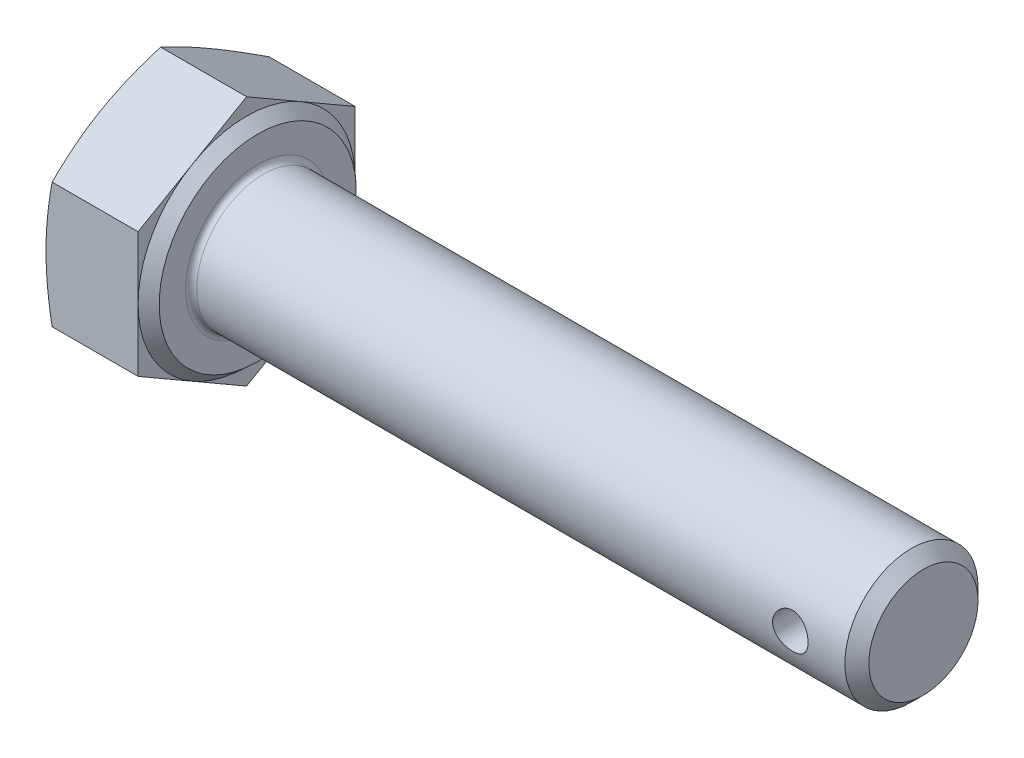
ISO-10303-21;
HEADER;
FILE_DESCRIPTION(('STEP AP214'),'2;1');
FILE_NAME('part.step','',(''),(''),'','','');
FILE_SCHEMA(('AUTOMOTIVE_DESIGN { 1 0 10303 214 1 1 1 1 }'));
ENDSEC;
DATA;
#1=APPLICATION_CONTEXT('core data for automotive mechanical design processes');
#2=APPLICATION_PROTOCOL_DEFINITION('international standard','automotive_design',2000,#1);
#3=PRODUCT_CONTEXT('',#1,'mechanical');
#4=PRODUCT('Part','Part','',(#3));
#5=PRODUCT_RELATED_PRODUCT_CATEGORY('part','',(#4));
#6=PRODUCT_DEFINITION_FORMATION('','',#4);
#7=PRODUCT_DEFINITION_CONTEXT('part definition',#1,'design');
#8=PRODUCT_DEFINITION('design','',#6,#7);
#9=PRODUCT_DEFINITION_SHAPE('','',#8);
#10=(LENGTH_UNIT() NAMED_UNIT(*) SI_UNIT(.MILLI.,.METRE.));
#11=(NAMED_UNIT(*) PLANE_ANGLE_UNIT() SI_UNIT($,.RADIAN.));
#12=(NAMED_UNIT(*) SI_UNIT($,.STERADIAN.) SOLID_ANGLE_UNIT());
#13=UNCERTAINTY_MEASURE_WITH_UNIT(LENGTH_MEASURE(1.E-05),#10,'distance_accuracy_value','');
#14=(GEOMETRIC_REPRESENTATION_CONTEXT(3) GLOBAL_UNCERTAINTY_ASSIGNED_CONTEXT((#13)) GLOBAL_UNIT_ASSIGNED_CONTEXT((#10,
#11,#12)) REPRESENTATION_CONTEXT('',''));
#15=CARTESIAN_POINT('',(0.,0.,0.));
#16=DIRECTION('',(0.,0.,1.));
#17=DIRECTION('',(1.,0.,0.));
#18=AXIS2_PLACEMENT_3D('',#15,#16,#17);
#19=CARTESIAN_POINT('',(4.65,0.,0.));
#20=DIRECTION('',(-1.,0.,0.));
#21=DIRECTION('',(0.,-1.,0.));
#22=AXIS2_PLACEMENT_3D('',#19,#20,#21);
#23=PLANE('',#22);
#24=CARTESIAN_POINT('',(4.65,0.,0.));
#25=DIRECTION('',(-1.,0.,0.));
#26=DIRECTION('',(0.,-1.,0.));
#27=AXIS2_PLACEMENT_3D('',#24,#25,#26);
#28=CIRCLE('',#27,3.25);
#29=CARTESIAN_POINT('',(4.65,-3.25,0.));
#30=VERTEX_POINT('',#29);
#31=EDGE_CURVE('E11',#30,#30,#28,.T.);
#32=ORIENTED_EDGE('',*,*,#31,.T.);
#33=EDGE_LOOP('',(#32));
#34=FACE_BOUND('',#33,.T.);
#35=CARTESIAN_POINT('',(4.65,0.,0.));
#36=DIRECTION('',(-1.,0.,0.));
#37=DIRECTION('',(0.,-1.,0.));
#38=AXIS2_PLACEMENT_3D('',#35,#36,#37);
#39=CIRCLE('',#38,4.44);
#40=CARTESIAN_POINT('',(4.65,-4.43999999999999,0.));
#41=VERTEX_POINT('',#40);
#42=EDGE_CURVE('E145',#41,#41,#39,.T.);
#43=ORIENTED_EDGE('',*,*,#42,.F.);
#44=EDGE_LOOP('',(#43));
#45=FACE_BOUND('',#44,.T.);
#46=ADVANCED_FACE('F32',(#34,#45),#23,.F.);
#47=CARTESIAN_POINT('',(4.15,-8.46972844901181,-4.89));
#48=DIRECTION('',(1.,0.,0.));
#49=DIRECTION('',(0.,0.,-1.));
#50=AXIS2_PLACEMENT_3D('',#47,#48,#49);
#51=PLANE('',#50);
#52=DIRECTION('',(0.,-0.5,-0.866025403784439));
#53=VECTOR('',#52,1.);
#54=CARTESIAN_POINT('',(4.15,-2.82324281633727,4.89));
#55=LINE('',#54,#53);
#56=CARTESIAN_POINT('',(4.15,-2.82324281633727,4.89));
#57=VERTEX_POINT('',#56);
#58=CARTESIAN_POINT('',(4.15,-4.2348642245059,2.445));
#59=VERTEX_POINT('',#58);
#60=EDGE_CURVE('E144',#57,#59,#55,.T.);
#61=ORIENTED_EDGE('',*,*,#60,.T.);
#62=CARTESIAN_POINT('',(4.15,0.,0.));
#63=DIRECTION('',(-1.,0.,0.));
#64=DIRECTION('',(0.,-1.,0.));
#65=AXIS2_PLACEMENT_3D('',#62,#63,#64);
#66=CIRCLE('',#65,4.89);
#67=CARTESIAN_POINT('',(4.15,0.,4.89));
#68=VERTEX_POINT('',#67);
#69=EDGE_CURVE('E54',#59,#68,#66,.T.);
#70=ORIENTED_EDGE('',*,*,#69,.T.);
#71=DIRECTION('',(0.,-1.,0.));
#72=VECTOR('',#71,1.);
#73=CARTESIAN_POINT('',(4.15,2.82324281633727,4.89));
#74=LINE('',#73,#72);
#75=EDGE_CURVE('E141',#68,#57,#74,.T.);
#76=ORIENTED_EDGE('',*,*,#75,.T.);
#77=EDGE_LOOP('',(#61,#70,#76));
#78=FACE_BOUND('',#77,.T.);
#79=ADVANCED_FACE('F140',(#78),#51,.T.);
#80=CARTESIAN_POINT('',(4.15,2.82324281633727,4.89));
#81=VERTEX_POINT('',#80);
#82=EDGE_CURVE('E152',#81,#68,#74,.T.);
#83=ORIENTED_EDGE('',*,*,#82,.T.);
#84=CARTESIAN_POINT('',(4.15,4.23486422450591,2.445));
#85=VERTEX_POINT('',#84);
#86=EDGE_CURVE('E127',#68,#85,#66,.T.);
#87=ORIENTED_EDGE('',*,*,#86,.T.);
#88=DIRECTION('',(0.,-0.5,0.866025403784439));
#89=VECTOR('',#88,1.);
#90=CARTESIAN_POINT('',(4.15,5.64648563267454,0.));
#91=LINE('',#90,#89);
#92=EDGE_CURVE('E158',#85,#81,#91,.T.);
#93=ORIENTED_EDGE('',*,*,#92,.T.);
#94=EDGE_LOOP('',(#83,#87,#93));
#95=FACE_BOUND('',#94,.T.);
#96=ADVANCED_FACE('F157',(#95),#51,.T.);
#97=CARTESIAN_POINT('',(4.15,5.64648563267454,0.));
#98=VERTEX_POINT('',#97);
#99=EDGE_CURVE('E155',#98,#85,#91,.T.);
#100=ORIENTED_EDGE('',*,*,#99,.T.);
#101=CARTESIAN_POINT('',(4.15,4.23486422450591,-2.445));
#102=VERTEX_POINT('',#101);
#103=EDGE_CURVE('E131',#85,#102,#66,.T.);
#104=ORIENTED_EDGE('',*,*,#103,.T.);
#105=DIRECTION('',(0.,0.5,0.866025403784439));
#106=VECTOR('',#105,1.);
#107=CARTESIAN_POINT('',(4.15,2.82324281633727,-4.89));
#108=LINE('',#107,#106);
#109=EDGE_CURVE('E324',#102,#98,#108,.T.);
#110=ORIENTED_EDGE('',*,*,#109,.T.);
#111=EDGE_LOOP('',(#100,#104,#110));
#112=FACE_BOUND('',#111,.T.);
#113=ADVANCED_FACE('F336',(#112),#51,.T.);
#114=CARTESIAN_POINT('',(4.15,2.82324281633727,-4.89));
#115=VERTEX_POINT('',#114);
#116=EDGE_CURVE('E326',#115,#102,#108,.T.);
#117=ORIENTED_EDGE('',*,*,#116,.T.);
#118=CARTESIAN_POINT('',(4.15,0.,-4.89));
#119=VERTEX_POINT('',#118);
#120=EDGE_CURVE('E379',#102,#119,#66,.T.);
#121=ORIENTED_EDGE('',*,*,#120,.T.);
#122=DIRECTION('',(0.,1.,0.));
#123=VECTOR('',#122,1.);
#124=CARTESIAN_POINT('',(4.15,-2.82324281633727,-4.89));
#125=LINE('',#124,#123);
#126=EDGE_CURVE('E321',#119,#115,#125,.T.);
#127=ORIENTED_EDGE('',*,*,#126,.T.);
#128=EDGE_LOOP('',(#117,#121,#127));
#129=FACE_BOUND('',#128,.T.);
#130=ADVANCED_FACE('F380',(#129),#51,.T.);
#131=CARTESIAN_POINT('',(4.15,-2.82324281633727,-4.89));
#132=VERTEX_POINT('',#131);
#133=EDGE_CURVE('E319',#132,#119,#125,.T.);
#134=ORIENTED_EDGE('',*,*,#133,.T.);
#135=CARTESIAN_POINT('',(4.15,-4.2348642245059,-2.445));
#136=VERTEX_POINT('',#135);
#137=EDGE_CURVE('E363',#119,#136,#66,.T.);
#138=ORIENTED_EDGE('',*,*,#137,.T.);
#139=DIRECTION('',(0.,0.5,-0.866025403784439));
#140=VECTOR('',#139,1.);
#141=CARTESIAN_POINT('',(4.15,-5.64648563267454,0.));
#142=LINE('',#141,#140);
#143=EDGE_CURVE('E377',#136,#132,#142,.T.);
#144=ORIENTED_EDGE('',*,*,#143,.T.);
#145=EDGE_LOOP('',(#134,#138,#144));
#146=FACE_BOUND('',#145,.T.);
#147=ADVANCED_FACE('F378',(#146),#51,.T.);
#148=CARTESIAN_POINT('',(4.15,-5.64648563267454,0.));
#149=VERTEX_POINT('',#148);
#150=EDGE_CURVE('E327',#149,#136,#142,.T.);
#151=ORIENTED_EDGE('',*,*,#150,.T.);
#152=EDGE_CURVE('E146',#136,#59,#66,.T.);
#153=ORIENTED_EDGE('',*,*,#152,.T.);
#154=EDGE_CURVE('E372',#59,#149,#55,.T.);
#155=ORIENTED_EDGE('',*,*,#154,.T.);
#156=EDGE_LOOP('',(#151,#153,#155));
#157=FACE_BOUND('',#156,.T.);
#158=ADVANCED_FACE('F224',(#157),#51,.T.);
#159=CARTESIAN_POINT('',(4.15,-2.82324281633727,4.89));
#160=DIRECTION('',(0.,0.866025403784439,-0.5));
#161=DIRECTION('',(0.,0.5,0.866025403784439));
#162=AXIS2_PLACEMENT_3D('',#159,#160,#161);
#163=PLANE('',#162);
#164=CARTESIAN_POINT('',(0.27538028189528,-5.64660110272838,-0.000199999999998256));
#165=CARTESIAN_POINT('',(0.232806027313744,-5.52967490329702,0.202322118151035));
#166=CARTESIAN_POINT('',(0.194077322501,-5.41236312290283,0.405512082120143));
#167=CARTESIAN_POINT('',(0.125940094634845,-5.17697676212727,0.813213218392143));
#168=CARTESIAN_POINT('',(0.0965388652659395,-5.05890165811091,1.01772529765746));
#169=CARTESIAN_POINT('',(0.0489831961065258,-4.82329906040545,1.42580096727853));
#170=CARTESIAN_POINT('',(0.0307250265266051,-4.7057769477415,1.62935523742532));
#171=CARTESIAN_POINT('',(0.00623568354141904,-4.470457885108,2.03693980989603));
#172=CARTESIAN_POINT('',(0.,-4.35266105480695,2.24096990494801));
#173=CARTESIAN_POINT('',(0.,-4.11706739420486,2.64903009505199));
#174=CARTESIAN_POINT('',(0.00623568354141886,-3.99927056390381,2.85306019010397));
#175=CARTESIAN_POINT('',(0.0307250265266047,-3.76395150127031,3.26064476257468));
#176=CARTESIAN_POINT('',(0.0489831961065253,-3.64642938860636,3.46419903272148));
#177=CARTESIAN_POINT('',(0.0965388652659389,-3.4108267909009,3.87227470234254));
#178=CARTESIAN_POINT('',(0.125940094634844,-3.29275168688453,4.07678678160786));
#179=CARTESIAN_POINT('',(0.194077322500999,-3.05736532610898,4.48448791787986));
#180=CARTESIAN_POINT('',(0.232806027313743,-2.94005354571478,4.68767788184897));
#181=CARTESIAN_POINT('',(0.27538028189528,-2.82312734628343,4.8902));
#182=B_SPLINE_CURVE_WITH_KNOTS('',3,(#164,#165,#166,#167,#168,#169,#170,#171,#172,#173,#174,
#175,#176,#177,#178,#179,#180,#181),.UNSPECIFIED.,.F.,.F.,(4,2,2,2,2,2,2,2,4),(0.,
0.713162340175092,1.42688097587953,2.13385008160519,2.84055392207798,3.54725776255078,
4.25422686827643,4.96794550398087,5.68110784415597),.UNSPECIFIED.);
#183=CARTESIAN_POINT('',(0.275338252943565,-5.64648563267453,0.));
#184=VERTEX_POINT('',#183);
#185=CARTESIAN_POINT('',(0.,-4.23486422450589,2.44499999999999));
#186=VERTEX_POINT('',#185);
#187=EDGE_CURVE('E366',#184,#186,#182,.T.);
#188=ORIENTED_EDGE('',*,*,#187,.F.);
#189=DIRECTION('',(-1.,0.,0.));
#190=VECTOR('',#189,1.);
#191=CARTESIAN_POINT('',(4.15,-5.64648563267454,0.));
#192=LINE('',#191,#190);
#193=EDGE_CURVE('E175',#149,#184,#192,.T.);
#194=ORIENTED_EDGE('',*,*,#193,.F.);
#195=ORIENTED_EDGE('',*,*,#154,.F.);
#196=ORIENTED_EDGE('',*,*,#60,.F.);
#197=DIRECTION('',(-1.,0.,0.));
#198=VECTOR('',#197,1.);
#199=CARTESIAN_POINT('',(4.15,-2.82324281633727,4.89));
#200=LINE('',#199,#198);
#201=CARTESIAN_POINT('',(0.275338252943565,-2.82324281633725,4.89));
#202=VERTEX_POINT('',#201);
#203=EDGE_CURVE('E154',#57,#202,#200,.T.);
#204=ORIENTED_EDGE('',*,*,#203,.T.);
#205=EDGE_CURVE('E256',#186,#202,#182,.T.);
#206=ORIENTED_EDGE('',*,*,#205,.F.);
#207=EDGE_LOOP('',(#188,#194,#195,#196,#204,#206));
#208=FACE_BOUND('',#207,.T.);
#209=ADVANCED_FACE('F34',(#208),#163,.F.);
#210=CARTESIAN_POINT('',(4.15,-5.64648563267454,0.));
#211=DIRECTION('',(0.,0.866025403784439,0.5));
#212=DIRECTION('',(0.,-0.5,0.866025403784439));
#213=AXIS2_PLACEMENT_3D('',#210,#211,#212);
#214=PLANE('',#213);
#215=CARTESIAN_POINT('',(0.275380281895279,-2.82312734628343,-4.8902));
#216=CARTESIAN_POINT('',(0.232806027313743,-2.94005354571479,-4.68767788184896));
#217=CARTESIAN_POINT('',(0.194077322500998,-3.05736532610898,-4.48448791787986));
#218=CARTESIAN_POINT('',(0.125940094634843,-3.29275168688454,-4.07678678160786));
#219=CARTESIAN_POINT('',(0.0965388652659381,-3.4108267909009,-3.87227470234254));
#220=CARTESIAN_POINT('',(0.0489831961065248,-3.64642938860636,-3.46419903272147));
#221=CARTESIAN_POINT('',(0.0307250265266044,-3.76395150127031,-3.26064476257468));
#222=CARTESIAN_POINT('',(0.0062356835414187,-3.99927056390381,-2.85306019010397));
#223=CARTESIAN_POINT('',(0.,-4.11706739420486,-2.64903009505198));
#224=CARTESIAN_POINT('',(0.,-4.35266105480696,-2.24096990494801));
#225=CARTESIAN_POINT('',(0.00623568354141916,-4.47045788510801,-2.03693980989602));
#226=CARTESIAN_POINT('',(0.0307250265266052,-4.7057769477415,-1.62935523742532));
#227=CARTESIAN_POINT('',(0.0489831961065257,-4.82329906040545,-1.42580096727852));
#228=CARTESIAN_POINT('',(0.0965388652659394,-5.05890165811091,-1.01772529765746));
#229=CARTESIAN_POINT('',(0.125940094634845,-5.17697676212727,-0.813213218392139));
#230=CARTESIAN_POINT('',(0.194077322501,-5.41236312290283,-0.405512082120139));
#231=CARTESIAN_POINT('',(0.232806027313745,-5.52967490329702,-0.202322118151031));
#232=CARTESIAN_POINT('',(0.275380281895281,-5.64660110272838,0.000200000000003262));
#233=B_SPLINE_CURVE_WITH_KNOTS('',3,(#215,#216,#217,#218,#219,#220,#221,#222,#223,#224,#225,
#226,#227,#228,#229,#230,#231,#232),.UNSPECIFIED.,.F.,.F.,(4,2,2,2,2,2,2,2,4),(0.,
0.713162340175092,1.42688097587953,2.13385008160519,2.84055392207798,3.54725776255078,
4.25422686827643,4.96794550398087,5.68110784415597),.UNSPECIFIED.);
#234=CARTESIAN_POINT('',(0.275338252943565,-2.82324281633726,-4.89));
#235=VERTEX_POINT('',#234);
#236=CARTESIAN_POINT('',(0.,-4.23486422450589,-2.445));
#237=VERTEX_POINT('',#236);
#238=EDGE_CURVE('E270',#235,#237,#233,.T.);
#239=ORIENTED_EDGE('',*,*,#238,.F.);
#240=DIRECTION('',(-1.,0.,0.));
#241=VECTOR('',#240,1.);
#242=CARTESIAN_POINT('',(4.15,-2.82324281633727,-4.89));
#243=LINE('',#242,#241);
#244=EDGE_CURVE('E172',#132,#235,#243,.T.);
#245=ORIENTED_EDGE('',*,*,#244,.F.);
#246=ORIENTED_EDGE('',*,*,#143,.F.);
#247=ORIENTED_EDGE('',*,*,#150,.F.);
#248=ORIENTED_EDGE('',*,*,#193,.T.);
#249=EDGE_CURVE('E266',#237,#184,#233,.T.);
#250=ORIENTED_EDGE('',*,*,#249,.F.);
#251=EDGE_LOOP('',(#239,#245,#246,#247,#248,#250));
#252=FACE_BOUND('',#251,.T.);
#253=ADVANCED_FACE('F277',(#252),#214,.F.);
#254=CARTESIAN_POINT('',(4.15,-2.82324281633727,-4.89));
#255=DIRECTION('',(0.,0.,1.));
#256=DIRECTION('',(1.,0.,0.));
#257=AXIS2_PLACEMENT_3D('',#254,#255,#256);
#258=PLANE('',#257);
#259=CARTESIAN_POINT('',(1.47129843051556,-7.47495425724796,-4.89));
#260=CARTESIAN_POINT('',(1.40393054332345,-7.25371297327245,-4.89));
#261=CARTESIAN_POINT('',(1.33734875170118,-7.03222787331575,-4.89));
#262=CARTESIAN_POINT('',(1.20619222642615,-6.5886459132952,-4.89));
#263=CARTESIAN_POINT('',(1.14161765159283,-6.36654900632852,-4.89));
#264=CARTESIAN_POINT('',(1.01480300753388,-5.92123916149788,-4.89));
#265=CARTESIAN_POINT('',(0.952567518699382,-5.69802491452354,-4.89));
#266=CARTESIAN_POINT('',(0.831159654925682,-5.25076608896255,-4.89));
#267=CARTESIAN_POINT('',(0.771987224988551,-5.0267215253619,-4.89));
#268=CARTESIAN_POINT('',(0.658168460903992,-4.58041494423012,-4.89));
#269=CARTESIAN_POINT('',(0.60347540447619,-4.35816490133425,-4.89));
#270=CARTESIAN_POINT('',(0.498748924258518,-3.91257162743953,-4.89));
#271=CARTESIAN_POINT('',(0.448715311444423,-3.68922844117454,-4.89));
#272=CARTESIAN_POINT('',(0.35446925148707,-3.24137981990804,-4.89));
#273=CARTESIAN_POINT('',(0.310254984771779,-3.01687477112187,-4.89));
#274=CARTESIAN_POINT('',(0.228995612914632,-2.56656126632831,-4.89));
#275=CARTESIAN_POINT('',(0.191950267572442,-2.34075285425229,-4.89));
#276=CARTESIAN_POINT('',(0.130201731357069,-1.91325953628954,-4.89));
#277=CARTESIAN_POINT('',(0.10458043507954,-1.71170849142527,-4.89));
#278=CARTESIAN_POINT('',(0.0612096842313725,-1.30775414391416,-4.89));
#279=CARTESIAN_POINT('',(0.0434600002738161,-1.1053508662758,-4.89));
#280=CARTESIAN_POINT('',(0.0166872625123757,-0.700102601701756,-4.89));
#281=CARTESIAN_POINT('',(0.00765803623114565,-0.497258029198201,-4.89));
#282=CARTESIAN_POINT('',(-0.0012166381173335,-0.0913659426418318,-4.89));
#283=CARTESIAN_POINT('',(-0.00106215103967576,0.1116815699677,-4.89));
#284=CARTESIAN_POINT('',(0.00844625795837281,0.518587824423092,-4.89));
#285=CARTESIAN_POINT('',(0.0178468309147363,0.72244545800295,-4.89));
#286=CARTESIAN_POINT('',(0.0454147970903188,1.12956194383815,-4.89));
#287=CARTESIAN_POINT('',(0.0635824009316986,1.33282078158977,-4.89));
#288=CARTESIAN_POINT('',(0.107834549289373,1.73863931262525,-4.89));
#289=CARTESIAN_POINT('',(0.133925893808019,1.94119825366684,-4.89));
#290=CARTESIAN_POINT('',(0.192967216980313,2.34530277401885,-4.89));
#291=CARTESIAN_POINT('',(0.225917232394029,2.54684834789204,-4.89));
#292=CARTESIAN_POINT('',(0.299499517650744,2.95953215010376,-4.89));
#293=CARTESIAN_POINT('',(0.340445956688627,3.1706138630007,-4.89));
#294=CARTESIAN_POINT('',(0.427609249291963,3.59169320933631,-4.89));
#295=CARTESIAN_POINT('',(0.473826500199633,3.80169075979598,-4.89));
#296=CARTESIAN_POINT('',(0.570557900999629,4.22074597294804,-4.89));
#297=CARTESIAN_POINT('',(0.621073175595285,4.42980337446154,-4.89));
#298=CARTESIAN_POINT('',(0.725589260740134,4.84704782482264,-4.89));
#299=CARTESIAN_POINT('',(0.779590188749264,5.05523484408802,-4.89));
#300=CARTESIAN_POINT('',(0.94594512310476,5.67918655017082,-4.89));
#301=CARTESIAN_POINT('',(1.06252765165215,6.09382208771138,-4.89));
#302=CARTESIAN_POINT('',(1.30317591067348,6.92081542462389,-4.89));
#303=CARTESIAN_POINT('',(1.42724045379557,7.33317357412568,-4.89));
#304=CARTESIAN_POINT('',(1.67916430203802,8.15174363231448,-4.89));
#305=CARTESIAN_POINT('',(1.80696660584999,8.55797314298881,-4.89));
#306=CARTESIAN_POINT('',(2.06620027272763,9.3692896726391,-4.89));
#307=CARTESIAN_POINT('',(2.197631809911,9.77437663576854,-4.89));
#308=CARTESIAN_POINT('',(2.46263754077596,10.5821449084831,-4.89));
#309=CARTESIAN_POINT('',(2.59620171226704,10.9848295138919,-4.89));
#310=CARTESIAN_POINT('',(2.86533263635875,11.7894926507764,-4.89));
#311=CARTESIAN_POINT('',(3.00089922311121,12.1914712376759,-4.89));
#312=CARTESIAN_POINT('',(3.13716622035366,12.5932087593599,-4.89));
#313=B_SPLINE_CURVE_WITH_KNOTS('',3,(#259,#260,#261,#262,#263,#264,#265,#266,#267,#268,#269,
#270,#271,#272,#273,#274,#275,#276,#277,#278,#279,#280,#281,#282,#283,#284,#285,#286,#287,#288,
#289,#290,#291,#292,#293,#294,#295,#296,#297,#298,#299,#300,#301,#302,#303,#304,#305,#306,#307,
#308,#309,#310,#311,#312),.UNSPECIFIED.,.F.,.F.,(4,2,2,2,2,2,2,2,2,2,2,2,2,2,2,2,2,2,2,2,2,2,2,
2,2,2,4),(0.,0.693817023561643,1.38768880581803,2.08285517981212,2.77800906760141,
3.46461177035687,4.15118660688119,4.83754625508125,5.52388290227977,6.1332681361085,
6.74263561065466,7.35157144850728,7.9605029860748,8.57252272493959,9.18455716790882,
9.79711833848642,10.4096827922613,11.0546498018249,11.6996654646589,12.3448504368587,
12.9900571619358,14.2820728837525,15.5738841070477,16.8514365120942,18.1290503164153,
19.4018164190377,20.6744776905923),.UNSPECIFIED.);
#314=CARTESIAN_POINT('',(0.275338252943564,2.82324281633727,-4.89));
#315=VERTEX_POINT('',#314);
#316=CARTESIAN_POINT('',(0.,0.,-4.88999999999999));
#317=VERTEX_POINT('',#316);
#318=EDGE_CURVE('E311',#315,#317,#313,.F.);
#319=ORIENTED_EDGE('',*,*,#318,.F.);
#320=DIRECTION('',(-1.,0.,0.));
#321=VECTOR('',#320,1.);
#322=CARTESIAN_POINT('',(4.15,2.82324281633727,-4.89));
#323=LINE('',#322,#321);
#324=EDGE_CURVE('E169',#115,#315,#323,.T.);
#325=ORIENTED_EDGE('',*,*,#324,.F.);
#326=ORIENTED_EDGE('',*,*,#126,.F.);
#327=ORIENTED_EDGE('',*,*,#133,.F.);
#328=ORIENTED_EDGE('',*,*,#244,.T.);
#329=EDGE_CURVE('E271',#317,#235,#313,.F.);
#330=ORIENTED_EDGE('',*,*,#329,.F.);
#331=EDGE_LOOP('',(#319,#325,#326,#327,#328,#330));
#332=FACE_BOUND('',#331,.T.);
#333=ADVANCED_FACE('F280',(#332),#258,.F.);
#334=CARTESIAN_POINT('',(4.15,2.82324281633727,-4.89));
#335=DIRECTION('',(0.,-0.866025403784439,0.5));
#336=DIRECTION('',(0.,-0.5,-0.866025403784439));
#337=AXIS2_PLACEMENT_3D('',#334,#335,#336);
#338=PLANE('',#337);
#339=CARTESIAN_POINT('',(0.275380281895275,5.64660110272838,0.0002));
#340=CARTESIAN_POINT('',(0.232806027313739,5.52967490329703,-0.202322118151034));
#341=CARTESIAN_POINT('',(0.194077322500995,5.41236312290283,-0.405512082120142));
#342=CARTESIAN_POINT('',(0.125940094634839,5.17697676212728,-0.813213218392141));
#343=CARTESIAN_POINT('',(0.0965388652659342,5.05890165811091,-1.01772529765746));
#344=CARTESIAN_POINT('',(0.0489831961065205,4.82329906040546,-1.42580096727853));
#345=CARTESIAN_POINT('',(0.0307250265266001,4.7057769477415,-1.62935523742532));
#346=CARTESIAN_POINT('',(0.00623568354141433,4.47045788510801,-2.03693980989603));
#347=CARTESIAN_POINT('',(0.,4.35266105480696,-2.24096990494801));
#348=CARTESIAN_POINT('',(0.,4.11706739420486,-2.64903009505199));
#349=CARTESIAN_POINT('',(0.00623568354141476,3.99927056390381,-2.85306019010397));
#350=CARTESIAN_POINT('',(0.030725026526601,3.76395150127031,-3.26064476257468));
#351=CARTESIAN_POINT('',(0.0489831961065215,3.64642938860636,-3.46419903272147));
#352=CARTESIAN_POINT('',(0.0965388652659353,3.4108267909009,-3.87227470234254));
#353=CARTESIAN_POINT('',(0.12594009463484,3.29275168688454,-4.07678678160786));
#354=CARTESIAN_POINT('',(0.194077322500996,3.05736532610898,-4.48448791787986));
#355=CARTESIAN_POINT('',(0.23280602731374,2.94005354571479,-4.68767788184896));
#356=CARTESIAN_POINT('',(0.275380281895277,2.82312734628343,-4.8902));
#357=B_SPLINE_CURVE_WITH_KNOTS('',3,(#339,#340,#341,#342,#343,#344,#345,#346,#347,#348,#349,
#350,#351,#352,#353,#354,#355,#356),.UNSPECIFIED.,.F.,.F.,(4,2,2,2,2,2,2,2,4),(0.,
0.713162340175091,1.42688097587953,2.13385008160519,2.84055392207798,3.54725776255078,
4.25422686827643,4.96794550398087,5.68110784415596),.UNSPECIFIED.);
#358=CARTESIAN_POINT('',(0.275338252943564,5.64648563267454,0.));
#359=VERTEX_POINT('',#358);
#360=CARTESIAN_POINT('',(0.,4.2348642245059,-2.445));
#361=VERTEX_POINT('',#360);
#362=EDGE_CURVE('E62',#359,#361,#357,.T.);
#363=ORIENTED_EDGE('',*,*,#362,.F.);
#364=DIRECTION('',(-1.,0.,0.));
#365=VECTOR('',#364,1.);
#366=CARTESIAN_POINT('',(4.15,5.64648563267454,0.));
#367=LINE('',#366,#365);
#368=EDGE_CURVE('E166',#98,#359,#367,.T.);
#369=ORIENTED_EDGE('',*,*,#368,.F.);
#370=ORIENTED_EDGE('',*,*,#109,.F.);
#371=ORIENTED_EDGE('',*,*,#116,.F.);
#372=ORIENTED_EDGE('',*,*,#324,.T.);
#373=EDGE_CURVE('E312',#361,#315,#357,.T.);
#374=ORIENTED_EDGE('',*,*,#373,.F.);
#375=EDGE_LOOP('',(#363,#369,#370,#371,#372,#374));
#376=FACE_BOUND('',#375,.T.);
#377=ADVANCED_FACE('F284',(#376),#338,.F.);
#378=CARTESIAN_POINT('',(4.15,5.64648563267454,0.));
#379=DIRECTION('',(0.,-0.866025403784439,-0.5));
#380=DIRECTION('',(0.,0.5,-0.866025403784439));
#381=AXIS2_PLACEMENT_3D('',#378,#379,#380);
#382=PLANE('',#381);
#383=CARTESIAN_POINT('',(0.275380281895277,2.82312734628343,4.8902));
#384=CARTESIAN_POINT('',(0.23280602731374,2.94005354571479,4.68767788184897));
#385=CARTESIAN_POINT('',(0.194077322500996,3.05736532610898,4.48448791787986));
#386=CARTESIAN_POINT('',(0.12594009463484,3.29275168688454,4.07678678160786));
#387=CARTESIAN_POINT('',(0.0965388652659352,3.4108267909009,3.87227470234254));
#388=CARTESIAN_POINT('',(0.0489831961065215,3.64642938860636,3.46419903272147));
#389=CARTESIAN_POINT('',(0.0307250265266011,3.76395150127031,3.26064476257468));
#390=CARTESIAN_POINT('',(0.00623568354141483,3.99927056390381,2.85306019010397));
#391=CARTESIAN_POINT('',(0.,4.11706739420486,2.64903009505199));
#392=CARTESIAN_POINT('',(0.,4.35266105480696,2.24096990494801));
#393=CARTESIAN_POINT('',(0.00623568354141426,4.47045788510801,2.03693980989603));
#394=CARTESIAN_POINT('',(0.0307250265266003,4.70577694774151,1.62935523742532));
#395=CARTESIAN_POINT('',(0.0489831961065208,4.82329906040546,1.42580096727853));
#396=CARTESIAN_POINT('',(0.0965388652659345,5.05890165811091,1.01772529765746));
#397=CARTESIAN_POINT('',(0.12594009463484,5.17697676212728,0.813213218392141));
#398=CARTESIAN_POINT('',(0.194077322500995,5.41236312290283,0.405512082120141));
#399=CARTESIAN_POINT('',(0.232806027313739,5.52967490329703,0.202322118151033));
#400=CARTESIAN_POINT('',(0.275380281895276,5.64660110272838,-0.000200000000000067));
#401=B_SPLINE_CURVE_WITH_KNOTS('',3,(#383,#384,#385,#386,#387,#388,#389,#390,#391,#392,#393,
#394,#395,#396,#397,#398,#399,#400),.UNSPECIFIED.,.F.,.F.,(4,2,2,2,2,2,2,2,4),(0.,
0.713162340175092,1.42688097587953,2.13385008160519,2.84055392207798,3.54725776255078,
4.25422686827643,4.96794550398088,5.68110784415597),.UNSPECIFIED.);
#402=CARTESIAN_POINT('',(0.275338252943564,2.82324281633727,4.89));
#403=VERTEX_POINT('',#402);
#404=CARTESIAN_POINT('',(0.,4.23486422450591,2.44499999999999));
#405=VERTEX_POINT('',#404);
#406=EDGE_CURVE('E249',#403,#405,#401,.T.);
#407=ORIENTED_EDGE('',*,*,#406,.F.);
#408=DIRECTION('',(-1.,0.,0.));
#409=VECTOR('',#408,1.);
#410=CARTESIAN_POINT('',(4.15,2.82324281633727,4.89));
#411=LINE('',#410,#409);
#412=EDGE_CURVE('E160',#81,#403,#411,.T.);
#413=ORIENTED_EDGE('',*,*,#412,.F.);
#414=ORIENTED_EDGE('',*,*,#92,.F.);
#415=ORIENTED_EDGE('',*,*,#99,.F.);
#416=ORIENTED_EDGE('',*,*,#368,.T.);
#417=EDGE_CURVE('E371',#405,#359,#401,.T.);
#418=ORIENTED_EDGE('',*,*,#417,.F.);
#419=EDGE_LOOP('',(#407,#413,#414,#415,#416,#418));
#420=FACE_BOUND('',#419,.T.);
#421=ADVANCED_FACE('F288',(#420),#382,.F.);
#422=CARTESIAN_POINT('',(4.15,2.82324281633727,4.89));
#423=DIRECTION('',(0.,0.,-1.));
#424=DIRECTION('',(-1.,0.,0.));
#425=AXIS2_PLACEMENT_3D('',#422,#423,#424);
#426=PLANE('',#425);
#427=CARTESIAN_POINT('',(1.47129843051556,-7.47495425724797,4.89));
#428=CARTESIAN_POINT('',(1.40393054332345,-7.25371297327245,4.89));
#429=CARTESIAN_POINT('',(1.33734875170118,-7.03222787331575,4.89));
#430=CARTESIAN_POINT('',(1.20619222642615,-6.5886459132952,4.89));
#431=CARTESIAN_POINT('',(1.14161765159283,-6.36654900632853,4.89));
#432=CARTESIAN_POINT('',(1.01480300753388,-5.92123916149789,4.89));
#433=CARTESIAN_POINT('',(0.952567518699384,-5.69802491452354,4.89));
#434=CARTESIAN_POINT('',(0.831159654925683,-5.25076608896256,4.89));
#435=CARTESIAN_POINT('',(0.771987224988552,-5.02672152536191,4.89));
#436=CARTESIAN_POINT('',(0.658168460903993,-4.58041494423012,4.89));
#437=CARTESIAN_POINT('',(0.603475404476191,-4.35816490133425,4.89));
#438=CARTESIAN_POINT('',(0.498748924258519,-3.91257162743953,4.89));
#439=CARTESIAN_POINT('',(0.448715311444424,-3.68922844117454,4.89));
#440=CARTESIAN_POINT('',(0.35446925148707,-3.24137981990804,4.89));
#441=CARTESIAN_POINT('',(0.31025498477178,-3.01687477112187,4.89));
#442=CARTESIAN_POINT('',(0.228995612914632,-2.56656126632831,4.89));
#443=CARTESIAN_POINT('',(0.191950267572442,-2.34075285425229,4.89));
#444=CARTESIAN_POINT('',(0.130201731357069,-1.91325953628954,4.89));
#445=CARTESIAN_POINT('',(0.104580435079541,-1.71170849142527,4.89));
#446=CARTESIAN_POINT('',(0.0612096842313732,-1.30775414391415,4.89));
#447=CARTESIAN_POINT('',(0.0434600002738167,-1.10535086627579,4.89));
#448=CARTESIAN_POINT('',(0.0166872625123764,-0.700102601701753,4.89));
#449=CARTESIAN_POINT('',(0.00765803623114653,-0.497258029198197,4.89));
#450=CARTESIAN_POINT('',(-0.00121663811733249,-0.0913659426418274,4.89));
#451=CARTESIAN_POINT('',(-0.00106215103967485,0.111681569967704,4.89));
#452=CARTESIAN_POINT('',(0.00844625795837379,0.518587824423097,4.89));
#453=CARTESIAN_POINT('',(0.0178468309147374,0.722445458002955,4.89));
#454=CARTESIAN_POINT('',(0.0454147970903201,1.12956194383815,4.89));
#455=CARTESIAN_POINT('',(0.0635824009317,1.33282078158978,4.89));
#456=CARTESIAN_POINT('',(0.107834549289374,1.73863931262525,4.89));
#457=CARTESIAN_POINT('',(0.13392589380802,1.94119825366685,4.89));
#458=CARTESIAN_POINT('',(0.192967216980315,2.34530277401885,4.89));
#459=CARTESIAN_POINT('',(0.225917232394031,2.54684834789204,4.89));
#460=CARTESIAN_POINT('',(0.299499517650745,2.95953215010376,4.89));
#461=CARTESIAN_POINT('',(0.340445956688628,3.1706138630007,4.89));
#462=CARTESIAN_POINT('',(0.427609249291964,3.59169320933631,4.89));
#463=CARTESIAN_POINT('',(0.473826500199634,3.80169075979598,4.89));
#464=CARTESIAN_POINT('',(0.57055790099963,4.22074597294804,4.89));
#465=CARTESIAN_POINT('',(0.621073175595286,4.42980337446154,4.89));
#466=CARTESIAN_POINT('',(0.725589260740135,4.84704782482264,4.89));
#467=CARTESIAN_POINT('',(0.779590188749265,5.05523484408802,4.89));
#468=CARTESIAN_POINT('',(0.945945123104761,5.67918655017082,4.89));
#469=CARTESIAN_POINT('',(1.06252765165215,6.09382208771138,4.89));
#470=CARTESIAN_POINT('',(1.30317591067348,6.92081542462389,4.89));
#471=CARTESIAN_POINT('',(1.42724045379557,7.33317357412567,4.89));
#472=CARTESIAN_POINT('',(1.67916430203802,8.15174363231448,4.89));
#473=CARTESIAN_POINT('',(1.80696660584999,8.5579731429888,4.89));
#474=CARTESIAN_POINT('',(2.06620027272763,9.3692896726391,4.89));
#475=CARTESIAN_POINT('',(2.197631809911,9.77437663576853,4.89));
#476=CARTESIAN_POINT('',(2.46263754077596,10.5821449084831,4.89));
#477=CARTESIAN_POINT('',(2.59620171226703,10.9848295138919,4.89));
#478=CARTESIAN_POINT('',(2.86533263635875,11.7894926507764,4.89));
#479=CARTESIAN_POINT('',(3.0008992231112,12.1914712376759,4.89));
#480=CARTESIAN_POINT('',(3.13716622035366,12.5932087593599,4.89));
#481=B_SPLINE_CURVE_WITH_KNOTS('',3,(#427,#428,#429,#430,#431,#432,#433,#434,#435,#436,#437,
#438,#439,#440,#441,#442,#443,#444,#445,#446,#447,#448,#449,#450,#451,#452,#453,#454,#455,#456,
#457,#458,#459,#460,#461,#462,#463,#464,#465,#466,#467,#468,#469,#470,#471,#472,#473,#474,#475,
#476,#477,#478,#479,#480),.UNSPECIFIED.,.F.,.F.,(4,2,2,2,2,2,2,2,2,2,2,2,2,2,2,2,2,2,2,2,2,2,2,
2,2,2,4),(0.,0.693817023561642,1.38768880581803,2.08285517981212,2.7780090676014,
3.46461177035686,4.15118660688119,4.83754625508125,5.52388290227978,6.1332681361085,
6.74263561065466,7.35157144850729,7.9605029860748,8.57252272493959,9.18455716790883,
9.79711833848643,10.4096827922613,11.0546498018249,11.6996654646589,12.3448504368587,
12.9900571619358,14.2820728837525,15.5738841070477,16.8514365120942,18.1290503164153,
19.4018164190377,20.6744776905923),.UNSPECIFIED.);
#482=CARTESIAN_POINT('',(0.,0.,4.89));
#483=VERTEX_POINT('',#482);
#484=EDGE_CURVE('E343',#202,#483,#481,.T.);
#485=ORIENTED_EDGE('',*,*,#484,.F.);
#486=ORIENTED_EDGE('',*,*,#203,.F.);
#487=ORIENTED_EDGE('',*,*,#75,.F.);
#488=ORIENTED_EDGE('',*,*,#82,.F.);
#489=ORIENTED_EDGE('',*,*,#412,.T.);
#490=EDGE_CURVE('E239',#483,#403,#481,.T.);
#491=ORIENTED_EDGE('',*,*,#490,.F.);
#492=EDGE_LOOP('',(#485,#486,#487,#488,#489,#491));
#493=FACE_BOUND('',#492,.T.);
#494=ADVANCED_FACE('F150',(#493),#426,.F.);
#495=CARTESIAN_POINT('',(0.,0.,0.));
#496=DIRECTION('',(1.,0.,0.));
#497=DIRECTION('',(0.,1.,0.));
#498=AXIS2_PLACEMENT_3D('',#495,#496,#497);
#499=CONICAL_SURFACE('',#498,4.88999999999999,1.22173047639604);
#500=ORIENTED_EDGE('',*,*,#329,.T.);
#501=ORIENTED_EDGE('',*,*,#238,.T.);
#502=CARTESIAN_POINT('',(0.,0.,0.));
#503=DIRECTION('',(1.,0.,0.));
#504=DIRECTION('',(0.,0.,-1.));
#505=AXIS2_PLACEMENT_3D('',#502,#503,#504);
#506=CIRCLE('',#505,4.88999999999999);
#507=EDGE_CURVE('E178',#237,#317,#506,.T.);
#508=ORIENTED_EDGE('',*,*,#507,.T.);
#509=EDGE_LOOP('',(#500,#501,#508));
#510=FACE_BOUND('',#509,.T.);
#511=ADVANCED_FACE('F234',(#510),#499,.T.);
#512=ORIENTED_EDGE('',*,*,#249,.T.);
#513=ORIENTED_EDGE('',*,*,#187,.T.);
#514=EDGE_CURVE('E181',#186,#237,#506,.T.);
#515=ORIENTED_EDGE('',*,*,#514,.T.);
#516=EDGE_LOOP('',(#512,#513,#515));
#517=FACE_BOUND('',#516,.T.);
#518=ADVANCED_FACE('F298',(#517),#499,.T.);
#519=ORIENTED_EDGE('',*,*,#205,.T.);
#520=ORIENTED_EDGE('',*,*,#484,.T.);
#521=CARTESIAN_POINT('',(0.,0.,0.));
#522=DIRECTION('',(-1.,0.,0.));
#523=DIRECTION('',(0.,-1.,0.));
#524=AXIS2_PLACEMENT_3D('',#521,#522,#523);
#525=CIRCLE('',#524,4.88999999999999);
#526=EDGE_CURVE('E346',#186,#483,#525,.T.);
#527=ORIENTED_EDGE('',*,*,#526,.F.);
#528=EDGE_LOOP('',(#519,#520,#527));
#529=FACE_BOUND('',#528,.T.);
#530=ADVANCED_FACE('F303',(#529),#499,.T.);
#531=ORIENTED_EDGE('',*,*,#406,.T.);
#532=EDGE_CURVE('E364',#405,#483,#506,.T.);
#533=ORIENTED_EDGE('',*,*,#532,.T.);
#534=ORIENTED_EDGE('',*,*,#490,.T.);
#535=EDGE_LOOP('',(#531,#533,#534));
#536=FACE_BOUND('',#535,.T.);
#537=ADVANCED_FACE('F235',(#536),#499,.T.);
#538=ORIENTED_EDGE('',*,*,#362,.T.);
#539=EDGE_CURVE('E361',#361,#405,#506,.T.);
#540=ORIENTED_EDGE('',*,*,#539,.T.);
#541=ORIENTED_EDGE('',*,*,#417,.T.);
#542=EDGE_LOOP('',(#538,#540,#541));
#543=FACE_BOUND('',#542,.T.);
#544=ADVANCED_FACE('F232',(#543),#499,.T.);
#545=ORIENTED_EDGE('',*,*,#318,.T.);
#546=EDGE_CURVE('E182',#317,#361,#506,.T.);
#547=ORIENTED_EDGE('',*,*,#546,.T.);
#548=ORIENTED_EDGE('',*,*,#373,.T.);
#549=EDGE_LOOP('',(#545,#547,#548));
#550=FACE_BOUND('',#549,.T.);
#551=ADVANCED_FACE('F227',(#550),#499,.T.);
#552=CARTESIAN_POINT('',(0.,-8.46972844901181,-4.89));
#553=DIRECTION('',(1.,0.,0.));
#554=DIRECTION('',(0.,0.,-1.));
#555=AXIS2_PLACEMENT_3D('',#552,#553,#554);
#556=PLANE('',#555);
#557=ORIENTED_EDGE('',*,*,#546,.F.);
#558=ORIENTED_EDGE('',*,*,#507,.F.);
#559=ORIENTED_EDGE('',*,*,#514,.F.);
#560=ORIENTED_EDGE('',*,*,#526,.T.);
#561=ORIENTED_EDGE('',*,*,#532,.F.);
#562=ORIENTED_EDGE('',*,*,#539,.F.);
#563=EDGE_LOOP('',(#557,#558,#559,#560,#561,#562));
#564=FACE_BOUND('',#563,.T.);
#565=ADVANCED_FACE('F231',(#564),#556,.F.);
#566=CARTESIAN_POINT('',(4.65,0.,0.));
#567=DIRECTION('',(-1.,0.,0.));
#568=DIRECTION('',(0.,-1.,0.));
#569=AXIS2_PLACEMENT_3D('',#566,#567,#568);
#570=CONICAL_SURFACE('',#569,4.44,0.732815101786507);
#571=ORIENTED_EDGE('',*,*,#69,.F.);
#572=ORIENTED_EDGE('',*,*,#152,.F.);
#573=ORIENTED_EDGE('',*,*,#137,.F.);
#574=ORIENTED_EDGE('',*,*,#120,.F.);
#575=ORIENTED_EDGE('',*,*,#103,.F.);
#576=ORIENTED_EDGE('',*,*,#86,.F.);
#577=EDGE_LOOP('',(#571,#572,#573,#574,#575,#576));
#578=FACE_BOUND('',#577,.T.);
#579=ORIENTED_EDGE('',*,*,#42,.T.);
#580=EDGE_LOOP('',(#579));
#581=FACE_BOUND('',#580,.T.);
#582=ADVANCED_FACE('F128',(#578,#581),#570,.T.);
#583=CARTESIAN_POINT('',(34.65,0.,0.));
#584=DIRECTION('',(-1.,0.,0.));
#585=DIRECTION('',(0.,-1.,0.));
#586=AXIS2_PLACEMENT_3D('',#583,#584,#585);
#587=CYLINDRICAL_SURFACE('',#586,3.);
#588=CARTESIAN_POINT('',(32.45,0.,-3.));
#589=CARTESIAN_POINT('',(32.4499989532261,0.0441018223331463,-2.99999933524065));
#590=CARTESIAN_POINT('',(32.4463409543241,0.088214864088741,-2.99901794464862));
#591=CARTESIAN_POINT('',(32.4318315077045,0.175170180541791,-2.99519829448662));
#592=CARTESIAN_POINT('',(32.4209765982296,0.21801183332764,-2.9923591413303));
#593=CARTESIAN_POINT('',(32.3924513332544,0.301156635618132,-2.98513733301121));
#594=CARTESIAN_POINT('',(32.3747897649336,0.341462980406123,-2.98075666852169));
#595=CARTESIAN_POINT('',(32.3331851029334,0.418541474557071,-2.97091479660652));
#596=CARTESIAN_POINT('',(32.3092415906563,0.455313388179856,-2.96545351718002));
#597=CARTESIAN_POINT('',(32.2551665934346,0.525131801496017,-2.95389845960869));
#598=CARTESIAN_POINT('',(32.2249165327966,0.558084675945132,-2.9477938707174));
#599=CARTESIAN_POINT('',(32.1593406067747,0.618514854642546,-2.93570963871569));
#600=CARTESIAN_POINT('',(32.1240140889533,0.645991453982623,-2.92973001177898));
#601=CARTESIAN_POINT('',(32.0485407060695,0.695145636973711,-2.91846214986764));
#602=CARTESIAN_POINT('',(32.0083214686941,0.716715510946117,-2.91318755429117));
#603=CARTESIAN_POINT('',(31.9246639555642,0.752750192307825,-2.90408590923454));
#604=CARTESIAN_POINT('',(31.8812262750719,0.767216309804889,-2.9002585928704));
#605=CARTESIAN_POINT('',(31.7934017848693,0.788307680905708,-2.89459646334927));
#606=CARTESIAN_POINT('',(31.7490585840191,0.795102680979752,-2.89271859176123));
#607=CARTESIAN_POINT('',(31.6598249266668,0.801188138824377,-2.89103932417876));
#608=CARTESIAN_POINT('',(31.6149345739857,0.80047999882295,-2.89123754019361));
#609=CARTESIAN_POINT('',(31.527205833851,0.791714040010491,-2.89364951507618));
#610=CARTESIAN_POINT('',(31.4843451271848,0.783861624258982,-2.89580694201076));
#611=CARTESIAN_POINT('',(31.4005726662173,0.761358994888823,-2.90180405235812));
#612=CARTESIAN_POINT('',(31.3596610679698,0.74670823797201,-2.90564387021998));
#613=CARTESIAN_POINT('',(31.2804127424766,0.710857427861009,-2.91462264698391));
#614=CARTESIAN_POINT('',(31.2421102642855,0.689585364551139,-2.91977577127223));
#615=CARTESIAN_POINT('',(31.1695463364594,0.641146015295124,-2.93079291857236));
#616=CARTESIAN_POINT('',(31.1352856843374,0.613977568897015,-2.93665708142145));
#617=CARTESIAN_POINT('',(31.0706044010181,0.55346642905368,-2.94867004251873));
#618=CARTESIAN_POINT('',(31.040345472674,0.519951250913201,-2.95482188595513));
#619=CARTESIAN_POINT('',(30.9858444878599,0.448247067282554,-2.96654552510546));
#620=CARTESIAN_POINT('',(30.961602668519,0.410057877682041,-2.97211729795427));
#621=CARTESIAN_POINT('',(30.9197528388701,0.329839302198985,-2.98208728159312));
#622=CARTESIAN_POINT('',(30.9021740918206,0.287793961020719,-2.98648029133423));
#623=CARTESIAN_POINT('',(30.8743811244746,0.201200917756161,-2.99356017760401));
#624=CARTESIAN_POINT('',(30.8641652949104,0.156653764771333,-2.996247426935));
#625=CARTESIAN_POINT('',(30.8516420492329,0.0677016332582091,-2.99955663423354));
#626=CARTESIAN_POINT('',(30.8491147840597,0.0233296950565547,-3.00023598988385));
#627=CARTESIAN_POINT('',(30.8514332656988,-0.0652040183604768,-2.99961788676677));
#628=CARTESIAN_POINT('',(30.8562782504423,-0.109365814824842,-2.99832063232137));
#629=CARTESIAN_POINT('',(30.873023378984,-0.195440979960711,-2.99393214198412));
#630=CARTESIAN_POINT('',(30.8848008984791,-0.237379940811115,-2.99087210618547));
#631=CARTESIAN_POINT('',(30.9149343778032,-0.318682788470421,-2.98330517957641));
#632=CARTESIAN_POINT('',(30.9332910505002,-0.358046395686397,-2.9787981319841));
#633=CARTESIAN_POINT('',(30.9764695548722,-0.433935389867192,-2.96870264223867));
#634=CARTESIAN_POINT('',(31.0014109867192,-0.470390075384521,-2.96309474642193));
#635=CARTESIAN_POINT('',(31.0569006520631,-0.538673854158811,-2.95144580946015));
#636=CARTESIAN_POINT('',(31.0874499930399,-0.570502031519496,-2.94540468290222));
#637=CARTESIAN_POINT('',(31.1543142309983,-0.629555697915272,-2.9333589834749));
#638=CARTESIAN_POINT('',(31.1907674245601,-0.65662607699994,-2.92736024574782));
#639=CARTESIAN_POINT('',(31.2678258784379,-0.704268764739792,-2.91626578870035));
#640=CARTESIAN_POINT('',(31.3084309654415,-0.724841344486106,-2.91117003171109));
#641=CARTESIAN_POINT('',(31.3924381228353,-0.758749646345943,-2.9025170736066));
#642=CARTESIAN_POINT('',(31.4358223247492,-0.772127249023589,-2.89895099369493));
#643=CARTESIAN_POINT('',(31.5243357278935,-0.791364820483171,-2.89375930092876));
#644=CARTESIAN_POINT('',(31.5694644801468,-0.79722671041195,-2.89213319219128));
#645=CARTESIAN_POINT('',(31.658597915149,-0.80115595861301,-2.89104697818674));
#646=CARTESIAN_POINT('',(31.7025909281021,-0.799472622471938,-2.89151759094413));
#647=CARTESIAN_POINT('',(31.7896414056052,-0.788937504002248,-2.89440958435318));
#648=CARTESIAN_POINT('',(31.8326988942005,-0.780085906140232,-2.89683091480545));
#649=CARTESIAN_POINT('',(31.9163423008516,-0.755610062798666,-2.903310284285));
#650=CARTESIAN_POINT('',(31.9569447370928,-0.740038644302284,-2.90735554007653));
#651=CARTESIAN_POINT('',(32.0349915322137,-0.702606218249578,-2.91662727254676));
#652=CARTESIAN_POINT('',(32.0724353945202,-0.680744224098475,-2.92185393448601));
#653=CARTESIAN_POINT('',(32.1442921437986,-0.630595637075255,-2.93309168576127));
#654=CARTESIAN_POINT('',(32.1785834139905,-0.602138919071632,-2.93912133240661));
#655=CARTESIAN_POINT('',(32.2419849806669,-0.539932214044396,-2.95118201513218));
#656=CARTESIAN_POINT('',(32.2710940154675,-0.506180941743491,-2.95721305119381));
#657=CARTESIAN_POINT('',(32.3239168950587,-0.433471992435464,-2.96875124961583));
#658=CARTESIAN_POINT('',(32.3475020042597,-0.394418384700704,-2.97424444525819));
#659=CARTESIAN_POINT('',(32.3877349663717,-0.312755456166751,-2.9839352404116));
#660=CARTESIAN_POINT('',(32.4043872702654,-0.270148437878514,-2.98813367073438));
#661=CARTESIAN_POINT('',(32.4281101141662,-0.189749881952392,-2.99421901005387));
#662=CARTESIAN_POINT('',(32.436299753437,-0.15230480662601,-2.99637108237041));
#663=CARTESIAN_POINT('',(32.4472448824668,-0.0765759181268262,-2.99926179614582));
#664=CARTESIAN_POINT('',(32.45000090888,-0.0382921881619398,-3.00000057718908));
#665=CARTESIAN_POINT('',(32.45,0.,-3.));
#666=B_SPLINE_CURVE_WITH_KNOTS('',3,(#588,#589,#590,#591,#592,#593,#594,#595,#596,#597,#598,
#599,#600,#601,#602,#603,#604,#605,#606,#607,#608,#609,#610,#611,#612,#613,#614,#615,#616,#617,
#618,#619,#620,#621,#622,#623,#624,#625,#626,#627,#628,#629,#630,#631,#632,#633,#634,#635,#636,
#637,#638,#639,#640,#641,#642,#643,#644,#645,#646,#647,#648,#649,#650,#651,#652,#653,#654,#655,
#656,#657,#658,#659,#660,#661,#662,#663,#664,#665),.UNSPECIFIED.,.T.,.F.,(4,2,2,2,2,2,2,2,2,2,2,
2,2,2,2,2,2,2,2,2,2,2,2,2,2,2,2,2,2,2,2,2,2,2,2,2,2,2,4),(0.,0.132165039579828,
0.264393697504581,0.396452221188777,0.528519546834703,0.663339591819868,0.798176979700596,
0.935330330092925,1.07245837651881,1.20648863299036,1.34049384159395,1.47076400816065,
1.60104458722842,1.73279469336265,1.86457075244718,2.00064503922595,2.13672468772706,
2.27339523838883,2.41003590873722,2.54273087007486,2.67541211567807,2.80581414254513,
2.93623030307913,3.06920114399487,3.20219827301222,3.33894598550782,3.4756879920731,
3.61162519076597,3.74752763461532,3.87897336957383,4.01041572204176,4.1408430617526,
4.2712908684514,4.40557735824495,4.53989649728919,4.67708900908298,4.81419330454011,
4.92895927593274,5.04371391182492),.UNSPECIFIED.);
#667=CARTESIAN_POINT('',(32.45,0.,-3.));
#668=VERTEX_POINT('',#667);
#669=EDGE_CURVE('E37',#668,#668,#666,.T.);
#670=ORIENTED_EDGE('',*,*,#669,.T.);
#671=EDGE_LOOP('',(#670));
#672=FACE_BOUND('',#671,.T.);
#673=CARTESIAN_POINT('',(32.45,0.,3.));
#674=CARTESIAN_POINT('',(32.4499989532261,-0.0441018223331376,2.99999933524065));
#675=CARTESIAN_POINT('',(32.4463409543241,-0.0882148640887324,2.99901794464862));
#676=CARTESIAN_POINT('',(32.4318315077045,-0.175170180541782,2.99519829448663));
#677=CARTESIAN_POINT('',(32.4209765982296,-0.218011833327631,2.9923591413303));
#678=CARTESIAN_POINT('',(32.3924513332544,-0.301156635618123,2.98513733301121));
#679=CARTESIAN_POINT('',(32.3747897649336,-0.341462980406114,2.98075666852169));
#680=CARTESIAN_POINT('',(32.3331851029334,-0.418541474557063,2.97091479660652));
#681=CARTESIAN_POINT('',(32.3092415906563,-0.455313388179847,2.96545351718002));
#682=CARTESIAN_POINT('',(32.2551665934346,-0.525131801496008,2.95389845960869));
#683=CARTESIAN_POINT('',(32.2249165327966,-0.558084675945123,2.9477938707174));
#684=CARTESIAN_POINT('',(32.1593406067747,-0.618514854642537,2.93570963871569));
#685=CARTESIAN_POINT('',(32.1240140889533,-0.645991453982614,2.92973001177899));
#686=CARTESIAN_POINT('',(32.0485407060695,-0.695145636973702,2.91846214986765));
#687=CARTESIAN_POINT('',(32.0083214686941,-0.716715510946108,2.91318755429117));
#688=CARTESIAN_POINT('',(31.9246639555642,-0.752750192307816,2.90408590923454));
#689=CARTESIAN_POINT('',(31.8812262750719,-0.76721630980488,2.9002585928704));
#690=CARTESIAN_POINT('',(31.7934017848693,-0.7883076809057,2.89459646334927));
#691=CARTESIAN_POINT('',(31.7490585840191,-0.795102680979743,2.89271859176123));
#692=CARTESIAN_POINT('',(31.6598249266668,-0.801188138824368,2.89103932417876));
#693=CARTESIAN_POINT('',(31.6149345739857,-0.800479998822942,2.89123754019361));
#694=CARTESIAN_POINT('',(31.527205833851,-0.791714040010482,2.89364951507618));
#695=CARTESIAN_POINT('',(31.4843451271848,-0.783861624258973,2.89580694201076));
#696=CARTESIAN_POINT('',(31.4005726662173,-0.761358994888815,2.90180405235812));
#697=CARTESIAN_POINT('',(31.3596610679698,-0.746708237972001,2.90564387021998));
#698=CARTESIAN_POINT('',(31.2804127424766,-0.710857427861,2.91462264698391));
#699=CARTESIAN_POINT('',(31.2421102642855,-0.689585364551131,2.91977577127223));
#700=CARTESIAN_POINT('',(31.1695463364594,-0.641146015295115,2.93079291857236));
#701=CARTESIAN_POINT('',(31.1352856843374,-0.613977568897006,2.93665708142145));
#702=CARTESIAN_POINT('',(31.0706044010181,-0.553466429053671,2.94867004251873));
#703=CARTESIAN_POINT('',(31.040345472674,-0.519951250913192,2.95482188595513));
#704=CARTESIAN_POINT('',(30.9858444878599,-0.448247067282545,2.96654552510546));
#705=CARTESIAN_POINT('',(30.961602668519,-0.410057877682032,2.97211729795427));
#706=CARTESIAN_POINT('',(30.9197528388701,-0.329839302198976,2.98208728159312));
#707=CARTESIAN_POINT('',(30.9021740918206,-0.28779396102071,2.98648029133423));
#708=CARTESIAN_POINT('',(30.8743811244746,-0.201200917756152,2.99356017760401));
#709=CARTESIAN_POINT('',(30.8641652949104,-0.156653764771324,2.996247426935));
#710=CARTESIAN_POINT('',(30.8516420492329,-0.0677016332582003,2.99955663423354));
#711=CARTESIAN_POINT('',(30.8491147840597,-0.0233296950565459,3.00023598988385));
#712=CARTESIAN_POINT('',(30.8514332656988,0.0652040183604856,2.99961788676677));
#713=CARTESIAN_POINT('',(30.8562782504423,0.109365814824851,2.99832063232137));
#714=CARTESIAN_POINT('',(30.873023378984,0.19544097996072,2.99393214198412));
#715=CARTESIAN_POINT('',(30.8848008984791,0.237379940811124,2.99087210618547));
#716=CARTESIAN_POINT('',(30.9149343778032,0.31868278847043,2.98330517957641));
#717=CARTESIAN_POINT('',(30.9332910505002,0.358046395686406,2.9787981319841));
#718=CARTESIAN_POINT('',(30.9764695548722,0.4339353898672,2.96870264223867));
#719=CARTESIAN_POINT('',(31.0014109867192,0.470390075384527,2.96309474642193));
#720=CARTESIAN_POINT('',(31.0569006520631,0.538673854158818,2.95144580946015));
#721=CARTESIAN_POINT('',(31.0874499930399,0.570502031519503,2.94540468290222));
#722=CARTESIAN_POINT('',(31.1543142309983,0.629555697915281,2.9333589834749));
#723=CARTESIAN_POINT('',(31.1907674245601,0.656626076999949,2.92736024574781));
#724=CARTESIAN_POINT('',(31.2678258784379,0.7042687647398,2.91626578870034));
#725=CARTESIAN_POINT('',(31.3084309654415,0.724841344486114,2.91117003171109));
#726=CARTESIAN_POINT('',(31.3924381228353,0.758749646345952,2.9025170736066));
#727=CARTESIAN_POINT('',(31.4358223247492,0.772127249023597,2.89895099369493));
#728=CARTESIAN_POINT('',(31.5243357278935,0.791364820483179,2.89375930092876));
#729=CARTESIAN_POINT('',(31.5694644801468,0.797226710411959,2.89213319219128));
#730=CARTESIAN_POINT('',(31.658597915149,0.801155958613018,2.89104697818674));
#731=CARTESIAN_POINT('',(31.7025909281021,0.799472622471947,2.89151759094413));
#732=CARTESIAN_POINT('',(31.7896414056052,0.788937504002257,2.89440958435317));
#733=CARTESIAN_POINT('',(31.8326988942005,0.780085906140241,2.89683091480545));
#734=CARTESIAN_POINT('',(31.9163423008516,0.755610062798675,2.90331028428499));
#735=CARTESIAN_POINT('',(31.9569447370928,0.740038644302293,2.90735554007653));
#736=CARTESIAN_POINT('',(32.0349915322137,0.702606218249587,2.91662727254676));
#737=CARTESIAN_POINT('',(32.0724353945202,0.680744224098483,2.92185393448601));
#738=CARTESIAN_POINT('',(32.1442921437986,0.630595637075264,2.93309168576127));
#739=CARTESIAN_POINT('',(32.1785834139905,0.60213891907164,2.93912133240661));
#740=CARTESIAN_POINT('',(32.2419849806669,0.539932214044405,2.95118201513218));
#741=CARTESIAN_POINT('',(32.2710940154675,0.506180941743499,2.95721305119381));
#742=CARTESIAN_POINT('',(32.3239168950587,0.433471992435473,2.96875124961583));
#743=CARTESIAN_POINT('',(32.3475020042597,0.394418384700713,2.97424444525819));
#744=CARTESIAN_POINT('',(32.3877349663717,0.31275545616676,2.9839352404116));
#745=CARTESIAN_POINT('',(32.4043872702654,0.270148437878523,2.98813367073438));
#746=CARTESIAN_POINT('',(32.4281101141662,0.1897498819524,2.99421901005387));
#747=CARTESIAN_POINT('',(32.436299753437,0.152304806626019,2.99637108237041));
#748=CARTESIAN_POINT('',(32.4472448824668,0.076575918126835,2.99926179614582));
#749=CARTESIAN_POINT('',(32.45000090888,0.0382921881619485,3.00000057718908));
#750=CARTESIAN_POINT('',(32.45,0.,3.));
#751=B_SPLINE_CURVE_WITH_KNOTS('',3,(#673,#674,#675,#676,#677,#678,#679,#680,#681,#682,#683,
#684,#685,#686,#687,#688,#689,#690,#691,#692,#693,#694,#695,#696,#697,#698,#699,#700,#701,#702,
#703,#704,#705,#706,#707,#708,#709,#710,#711,#712,#713,#714,#715,#716,#717,#718,#719,#720,#721,
#722,#723,#724,#725,#726,#727,#728,#729,#730,#731,#732,#733,#734,#735,#736,#737,#738,#739,#740,
#741,#742,#743,#744,#745,#746,#747,#748,#749,#750),.UNSPECIFIED.,.T.,.F.,(4,2,2,2,2,2,2,2,2,2,2,
2,2,2,2,2,2,2,2,2,2,2,2,2,2,2,2,2,2,2,2,2,2,2,2,2,2,2,4),(0.,0.132165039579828,
0.264393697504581,0.396452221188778,0.528519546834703,0.663339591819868,0.798176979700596,
0.935330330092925,1.07245837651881,1.20648863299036,1.34049384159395,1.47076400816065,
1.60104458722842,1.73279469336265,1.86457075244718,2.00064503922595,2.13672468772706,
2.27339523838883,2.41003590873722,2.54273087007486,2.67541211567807,2.80581414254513,
2.93623030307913,3.06920114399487,3.20219827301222,3.33894598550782,3.4756879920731,
3.61162519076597,3.74752763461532,3.87897336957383,4.01041572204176,4.1408430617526,
4.2712908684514,4.40557735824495,4.53989649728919,4.67708900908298,4.81419330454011,
4.92895927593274,5.04371391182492),.UNSPECIFIED.);
#752=CARTESIAN_POINT('',(32.45,0.,3.));
#753=VERTEX_POINT('',#752);
#754=EDGE_CURVE('E189',#753,#753,#751,.T.);
#755=ORIENTED_EDGE('',*,*,#754,.T.);
#756=EDGE_LOOP('',(#755));
#757=FACE_BOUND('',#756,.T.);
#758=CARTESIAN_POINT('',(4.9,0.,0.));
#759=DIRECTION('',(-1.,0.,0.));
#760=DIRECTION('',(0.,-1.,0.));
#761=AXIS2_PLACEMENT_3D('',#758,#759,#760);
#762=CIRCLE('',#761,3.);
#763=CARTESIAN_POINT('',(4.9,-3.,0.));
#764=VERTEX_POINT('',#763);
#765=EDGE_CURVE('E46',#764,#764,#762,.F.);
#766=ORIENTED_EDGE('',*,*,#765,.T.);
#767=EDGE_LOOP('',(#766));
#768=FACE_BOUND('',#767,.T.);
#769=CARTESIAN_POINT('',(34.1085,0.,0.));
#770=DIRECTION('',(1.,0.,0.));
#771=DIRECTION('',(0.,1.,0.));
#772=AXIS2_PLACEMENT_3D('',#769,#770,#771);
#773=CIRCLE('',#772,3.);
#774=CARTESIAN_POINT('',(34.1085,3.,0.));
#775=VERTEX_POINT('',#774);
#776=EDGE_CURVE('E185',#775,#775,#773,.F.);
#777=ORIENTED_EDGE('',*,*,#776,.T.);
#778=EDGE_LOOP('',(#777));
#779=FACE_BOUND('',#778,.T.);
#780=ADVANCED_FACE('F193',(#672,#757,#768,#779),#587,.T.);
#781=CARTESIAN_POINT('',(34.65,0.,0.));
#782=DIRECTION('',(1.,0.,0.));
#783=DIRECTION('',(0.,1.,0.));
#784=AXIS2_PLACEMENT_3D('',#781,#782,#783);
#785=PLANE('',#784);
#786=CARTESIAN_POINT('',(34.65,0.,0.));
#787=DIRECTION('',(1.,0.,0.));
#788=DIRECTION('',(0.,1.,0.));
#789=AXIS2_PLACEMENT_3D('',#786,#787,#788);
#790=CIRCLE('',#789,2.4585);
#791=CARTESIAN_POINT('',(34.65,2.4585,0.));
#792=VERTEX_POINT('',#791);
#793=EDGE_CURVE('E135',#792,#792,#790,.T.);
#794=ORIENTED_EDGE('',*,*,#793,.T.);
#795=EDGE_LOOP('',(#794));
#796=FACE_BOUND('',#795,.T.);
#797=ADVANCED_FACE('F209',(#796),#785,.T.);
#798=CARTESIAN_POINT('',(34.65,0.,0.));
#799=DIRECTION('',(-1.,0.,0.));
#800=DIRECTION('',(0.,-1.,0.));
#801=AXIS2_PLACEMENT_3D('',#798,#799,#800);
#802=CONICAL_SURFACE('',#801,2.4585,0.785398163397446);
#803=ORIENTED_EDGE('',*,*,#776,.F.);
#804=EDGE_LOOP('',(#803));
#805=FACE_BOUND('',#804,.T.);
#806=ORIENTED_EDGE('',*,*,#793,.F.);
#807=EDGE_LOOP('',(#806));
#808=FACE_BOUND('',#807,.T.);
#809=ADVANCED_FACE('F206',(#805,#808),#802,.T.);
#810=CARTESIAN_POINT('',(4.9,0.,0.));
#811=DIRECTION('',(-1.,0.,0.));
#812=DIRECTION('',(0.,-1.,0.));
#813=AXIS2_PLACEMENT_3D('',#810,#811,#812);
#814=TOROIDAL_SURFACE('',#813,3.25,0.25);
#815=ORIENTED_EDGE('',*,*,#31,.F.);
#816=EDGE_LOOP('',(#815));
#817=FACE_BOUND('',#816,.T.);
#818=ORIENTED_EDGE('',*,*,#765,.F.);
#819=EDGE_LOOP('',(#818));
#820=FACE_BOUND('',#819,.T.);
#821=ADVANCED_FACE('F201',(#817,#820),#814,.F.);
#822=CARTESIAN_POINT('',(31.65,0.,-4.89));
#823=DIRECTION('',(0.,0.,1.));
#824=DIRECTION('',(1.,0.,0.));
#825=AXIS2_PLACEMENT_3D('',#822,#823,#824);
#826=CYLINDRICAL_SURFACE('',#825,0.800000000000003);
#827=ORIENTED_EDGE('',*,*,#754,.F.);
#828=EDGE_LOOP('',(#827));
#829=FACE_BOUND('',#828,.T.);
#830=ORIENTED_EDGE('',*,*,#669,.F.);
#831=EDGE_LOOP('',(#830));
#832=FACE_BOUND('',#831,.T.);
#833=ADVANCED_FACE('F197',(#829,#832),#826,.F.);
#834=CLOSED_SHELL('',(#46,#79,#96,#113,#130,#147,#158,#209,#253,#333,#377,#421,#494,#511,#518,
#530,#537,#544,#551,#565,#582,#780,#797,#809,#821,#833));
#835=MANIFOLD_SOLID_BREP('B2',#834);
#836=ADVANCED_BREP_SHAPE_REPRESENTATION('',(#18,#835),#14);
#837=SHAPE_DEFINITION_REPRESENTATION(#9,#836);
ENDSEC;
END-ISO-10303-21;
